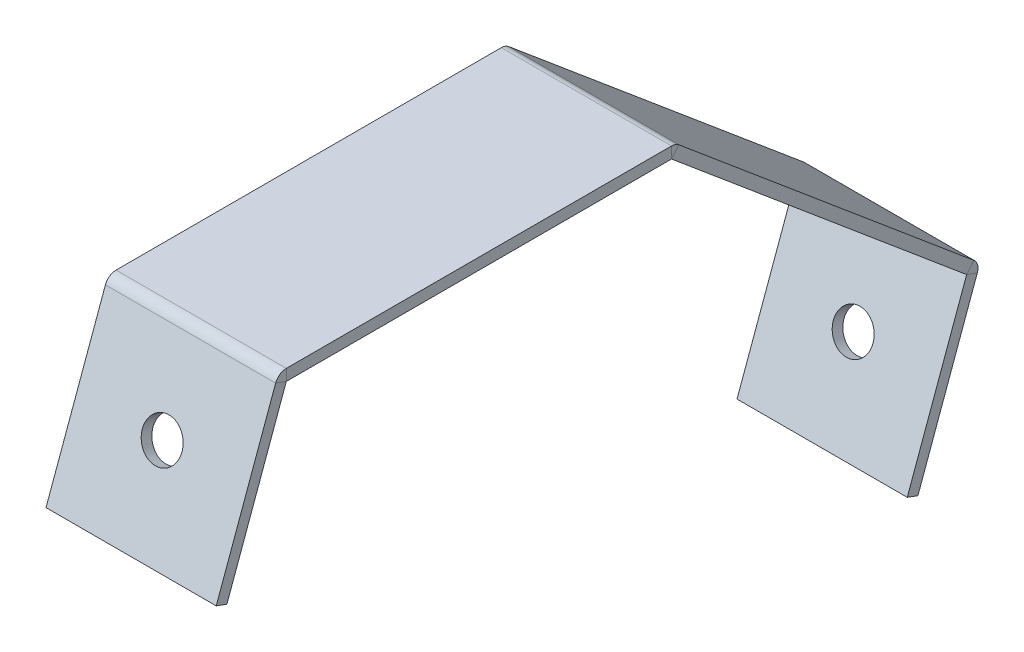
ISO-10303-21;
HEADER;
FILE_DESCRIPTION(('STEP AP214'),'2;1');
FILE_NAME('part.step','',(''),(''),'','','');
FILE_SCHEMA(('AUTOMOTIVE_DESIGN { 1 0 10303 214 1 1 1 1 }'));
ENDSEC;
DATA;
#1=APPLICATION_CONTEXT('core data for automotive mechanical design processes');
#2=APPLICATION_PROTOCOL_DEFINITION('international standard','automotive_design',2000,#1);
#3=PRODUCT_CONTEXT('',#1,'mechanical');
#4=PRODUCT('Part','Part','',(#3));
#5=PRODUCT_RELATED_PRODUCT_CATEGORY('part','',(#4));
#6=PRODUCT_DEFINITION_FORMATION('','',#4);
#7=PRODUCT_DEFINITION_CONTEXT('part definition',#1,'design');
#8=PRODUCT_DEFINITION('design','',#6,#7);
#9=PRODUCT_DEFINITION_SHAPE('','',#8);
#10=(LENGTH_UNIT() NAMED_UNIT(*) SI_UNIT(.MILLI.,.METRE.));
#11=(NAMED_UNIT(*) PLANE_ANGLE_UNIT() SI_UNIT($,.RADIAN.));
#12=(NAMED_UNIT(*) SI_UNIT($,.STERADIAN.) SOLID_ANGLE_UNIT());
#13=UNCERTAINTY_MEASURE_WITH_UNIT(LENGTH_MEASURE(1.E-05),#10,'distance_accuracy_value','');
#14=(GEOMETRIC_REPRESENTATION_CONTEXT(3) GLOBAL_UNCERTAINTY_ASSIGNED_CONTEXT((#13)) GLOBAL_UNIT_ASSIGNED_CONTEXT((#10,
#11,#12)) REPRESENTATION_CONTEXT('',''));
#15=CARTESIAN_POINT('',(0.,0.,0.));
#16=DIRECTION('',(0.,0.,1.));
#17=DIRECTION('',(1.,0.,0.));
#18=AXIS2_PLACEMENT_3D('',#15,#16,#17);
#19=CARTESIAN_POINT('',(0.,-31.785382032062,-90.0770968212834));
#20=DIRECTION('',(0.,-0.766044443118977,0.642787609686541));
#21=DIRECTION('',(0.,-0.642787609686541,-0.766044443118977));
#22=AXIS2_PLACEMENT_3D('',#19,#20,#21);
#23=PLANE('',#22);
#24=DIRECTION('',(0.,0.642787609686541,0.766044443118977));
#25=VECTOR('',#24,1.);
#26=CARTESIAN_POINT('',(0.,33.7789541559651,-11.9405636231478));
#27=LINE('',#26,#25);
#28=CARTESIAN_POINT('',(0.,-21.0539094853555,-77.2878258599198));
#29=VERTEX_POINT('',#28);
#30=CARTESIAN_POINT('',(0.,0.766044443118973,-51.2838173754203));
#31=VERTEX_POINT('',#30);
#32=EDGE_CURVE('E48',#29,#31,#27,.T.);
#33=ORIENTED_EDGE('',*,*,#32,.T.);
#34=DIRECTION('',(1.,0.,0.));
#35=VECTOR('',#34,1.);
#36=CARTESIAN_POINT('',(0.,0.766044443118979,-51.2838173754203));
#37=LINE('',#36,#35);
#38=CARTESIAN_POINT('',(15.,0.766044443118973,-51.2838173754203));
#39=VERTEX_POINT('',#38);
#40=EDGE_CURVE('E169',#31,#39,#37,.T.);
#41=ORIENTED_EDGE('',*,*,#40,.T.);
#42=DIRECTION('',(0.,-0.642787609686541,-0.766044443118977));
#43=VECTOR('',#42,1.);
#44=CARTESIAN_POINT('',(15.,33.7789541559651,-11.9405636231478));
#45=LINE('',#44,#43);
#46=CARTESIAN_POINT('',(15.,-21.0539094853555,-77.2878258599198));
#47=VERTEX_POINT('',#46);
#48=EDGE_CURVE('E227',#39,#47,#45,.T.);
#49=ORIENTED_EDGE('',*,*,#48,.T.);
#50=DIRECTION('',(-1.,0.,0.));
#51=VECTOR('',#50,1.);
#52=CARTESIAN_POINT('',(0.,-21.0539094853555,-77.2878258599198));
#53=LINE('',#52,#51);
#54=EDGE_CURVE('E223',#47,#29,#53,.T.);
#55=ORIENTED_EDGE('',*,*,#54,.T.);
#56=EDGE_LOOP('',(#33,#41,#49,#55));
#57=FACE_BOUND('',#56,.T.);
#58=ADVANCED_FACE('F44',(#57),#23,.F.);
#59=CARTESIAN_POINT('',(0.,33.7789541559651,-11.9405636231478));
#60=DIRECTION('',(1.,0.,0.));
#61=DIRECTION('',(0.,-0.642787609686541,-0.766044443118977));
#62=AXIS2_PLACEMENT_3D('',#59,#60,#61);
#63=PLANE('',#62);
#64=DIRECTION('',(0.,0.642787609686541,0.766044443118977));
#65=VECTOR('',#64,1.);
#66=CARTESIAN_POINT('',(0.,33.0129097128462,-11.2977760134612));
#67=LINE('',#66,#65);
#68=CARTESIAN_POINT('',(0.,-21.8199539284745,-76.6450382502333));
#69=VERTEX_POINT('',#68);
#70=CARTESIAN_POINT('',(0.,0.,-50.6410297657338));
#71=VERTEX_POINT('',#70);
#72=EDGE_CURVE('E222',#69,#71,#67,.T.);
#73=ORIENTED_EDGE('',*,*,#72,.T.);
#74=DIRECTION('',(0.,0.766044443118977,-0.642787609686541));
#75=VECTOR('',#74,1.);
#76=CARTESIAN_POINT('',(0.,0.766044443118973,-51.2838173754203));
#77=LINE('',#76,#75);
#78=EDGE_CURVE('E53',#71,#31,#77,.T.);
#79=ORIENTED_EDGE('',*,*,#78,.T.);
#80=ORIENTED_EDGE('',*,*,#32,.F.);
#81=DIRECTION('',(0.,-0.766044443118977,0.642787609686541));
#82=VECTOR('',#81,1.);
#83=CARTESIAN_POINT('',(0.,-21.0539094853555,-77.2878258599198));
#84=LINE('',#83,#82);
#85=EDGE_CURVE('E233',#29,#69,#84,.T.);
#86=ORIENTED_EDGE('',*,*,#85,.T.);
#87=EDGE_LOOP('',(#73,#79,#80,#86));
#88=FACE_BOUND('',#87,.T.);
#89=ADVANCED_FACE('F245',(#88),#63,.F.);
#90=CARTESIAN_POINT('',(15.,33.7789541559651,-11.9405636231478));
#91=DIRECTION('',(-1.,0.,0.));
#92=DIRECTION('',(0.,0.642787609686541,0.766044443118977));
#93=AXIS2_PLACEMENT_3D('',#90,#91,#92);
#94=PLANE('',#93);
#95=ORIENTED_EDGE('',*,*,#48,.F.);
#96=DIRECTION('',(0.,-0.766044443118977,0.642787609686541));
#97=VECTOR('',#96,1.);
#98=CARTESIAN_POINT('',(15.,0.766044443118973,-51.2838173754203));
#99=LINE('',#98,#97);
#100=CARTESIAN_POINT('',(15.,0.,-50.6410297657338));
#101=VERTEX_POINT('',#100);
#102=EDGE_CURVE('E12',#39,#101,#99,.T.);
#103=ORIENTED_EDGE('',*,*,#102,.T.);
#104=DIRECTION('',(0.,-0.642787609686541,-0.766044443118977));
#105=VECTOR('',#104,1.);
#106=CARTESIAN_POINT('',(15.,33.0129097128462,-11.2977760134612));
#107=LINE('',#106,#105);
#108=CARTESIAN_POINT('',(15.,-21.8199539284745,-76.6450382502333));
#109=VERTEX_POINT('',#108);
#110=EDGE_CURVE('E238',#101,#109,#107,.T.);
#111=ORIENTED_EDGE('',*,*,#110,.T.);
#112=DIRECTION('',(0.,0.766044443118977,-0.642787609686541));
#113=VECTOR('',#112,1.);
#114=CARTESIAN_POINT('',(15.,-21.0539094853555,-77.2878258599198));
#115=LINE('',#114,#113);
#116=EDGE_CURVE('E226',#109,#47,#115,.T.);
#117=ORIENTED_EDGE('',*,*,#116,.T.);
#118=EDGE_LOOP('',(#95,#103,#111,#117));
#119=FACE_BOUND('',#118,.T.);
#120=ADVANCED_FACE('F46',(#119),#94,.F.);
#121=CARTESIAN_POINT('',(0.,-32.551426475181,-89.4343092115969));
#122=DIRECTION('',(0.,-0.766044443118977,0.642787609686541));
#123=DIRECTION('',(0.,-0.642787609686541,-0.766044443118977));
#124=AXIS2_PLACEMENT_3D('',#121,#122,#123);
#125=PLANE('',#124);
#126=DIRECTION('',(1.,0.,0.));
#127=VECTOR('',#126,1.);
#128=CARTESIAN_POINT('',(0.,0.,-50.6410297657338));
#129=LINE('',#128,#127);
#130=EDGE_CURVE('E252',#71,#101,#129,.T.);
#131=ORIENTED_EDGE('',*,*,#130,.F.);
#132=ORIENTED_EDGE('',*,*,#72,.F.);
#133=DIRECTION('',(-1.,0.,0.));
#134=VECTOR('',#133,1.);
#135=CARTESIAN_POINT('',(0.,-21.8199539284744,-76.6450382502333));
#136=LINE('',#135,#134);
#137=EDGE_CURVE('E230',#109,#69,#136,.T.);
#138=ORIENTED_EDGE('',*,*,#137,.F.);
#139=ORIENTED_EDGE('',*,*,#110,.F.);
#140=EDGE_LOOP('',(#131,#132,#138,#139));
#141=FACE_BOUND('',#140,.T.);
#142=ADVANCED_FACE('F253',(#141),#125,.T.);
#143=CARTESIAN_POINT('',(15.,-21.8199539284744,-76.6450382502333));
#144=DIRECTION('',(1.,0.,0.));
#145=DIRECTION('',(0.,-0.642787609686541,-0.766044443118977));
#146=AXIS2_PLACEMENT_3D('',#143,#144,#145);
#147=CYLINDRICAL_SURFACE('',#146,1.);
#148=CARTESIAN_POINT('',(15.,-21.8199539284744,-76.6450382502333));
#149=DIRECTION('',(1.,0.,0.));
#150=DIRECTION('',(0.,-0.642787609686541,-0.766044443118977));
#151=AXIS2_PLACEMENT_3D('',#148,#149,#150);
#152=CIRCLE('',#151,1.);
#153=CARTESIAN_POINT('',(15.,-22.1619740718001,-77.5847308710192));
#154=VERTEX_POINT('',#153);
#155=EDGE_CURVE('E219',#154,#47,#152,.T.);
#156=ORIENTED_EDGE('',*,*,#155,.F.);
#157=DIRECTION('',(-1.,0.,0.));
#158=VECTOR('',#157,1.);
#159=CARTESIAN_POINT('',(0.,-22.1619740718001,-77.5847308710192));
#160=LINE('',#159,#158);
#161=CARTESIAN_POINT('',(0.,-22.1619740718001,-77.5847308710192));
#162=VERTEX_POINT('',#161);
#163=EDGE_CURVE('E214',#154,#162,#160,.T.);
#164=ORIENTED_EDGE('',*,*,#163,.T.);
#165=CARTESIAN_POINT('',(0.,-21.8199539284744,-76.6450382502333));
#166=DIRECTION('',(1.,0.,0.));
#167=DIRECTION('',(0.,-0.642787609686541,-0.766044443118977));
#168=AXIS2_PLACEMENT_3D('',#165,#166,#167);
#169=CIRCLE('',#168,1.);
#170=EDGE_CURVE('E186',#162,#29,#169,.T.);
#171=ORIENTED_EDGE('',*,*,#170,.T.);
#172=ORIENTED_EDGE('',*,*,#54,.F.);
#173=EDGE_LOOP('',(#156,#164,#171,#172));
#174=FACE_BOUND('',#173,.T.);
#175=ADVANCED_FACE('F356',(#174),#147,.T.);
#176=CARTESIAN_POINT('',(15.,-22.1619740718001,-77.5847308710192));
#177=DIRECTION('',(1.,0.,0.));
#178=DIRECTION('',(0.,-0.642787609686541,-0.766044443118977));
#179=AXIS2_PLACEMENT_3D('',#176,#177,#178);
#180=PLANE('',#179);
#181=ORIENTED_EDGE('',*,*,#116,.F.);
#182=DIRECTION('',(0.,-0.342020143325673,-0.939692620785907));
#183=VECTOR('',#182,1.);
#184=CARTESIAN_POINT('',(15.,-22.1619740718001,-77.5847308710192));
#185=LINE('',#184,#183);
#186=EDGE_CURVE('E208',#109,#154,#185,.T.);
#187=ORIENTED_EDGE('',*,*,#186,.T.);
#188=ORIENTED_EDGE('',*,*,#155,.T.);
#189=EDGE_LOOP('',(#181,#187,#188));
#190=FACE_BOUND('',#189,.T.);
#191=ADVANCED_FACE('F353',(#190),#180,.T.);
#192=CARTESIAN_POINT('',(0.,-22.1619740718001,-77.5847308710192));
#193=DIRECTION('',(-1.,0.,0.));
#194=DIRECTION('',(0.,0.642787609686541,0.766044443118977));
#195=AXIS2_PLACEMENT_3D('',#192,#193,#194);
#196=PLANE('',#195);
#197=DIRECTION('',(0.,0.342020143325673,0.939692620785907));
#198=VECTOR('',#197,1.);
#199=CARTESIAN_POINT('',(0.,-22.1619740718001,-77.5847308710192));
#200=LINE('',#199,#198);
#201=EDGE_CURVE('E211',#162,#69,#200,.T.);
#202=ORIENTED_EDGE('',*,*,#201,.T.);
#203=ORIENTED_EDGE('',*,*,#85,.F.);
#204=ORIENTED_EDGE('',*,*,#170,.F.);
#205=EDGE_LOOP('',(#202,#203,#204));
#206=FACE_BOUND('',#205,.T.);
#207=ADVANCED_FACE('F377',(#206),#196,.T.);
#208=CARTESIAN_POINT('',(7.5,-29.026233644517,-75.0863447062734));
#209=DIRECTION('',(0.,0.342020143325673,0.939692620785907));
#210=DIRECTION('',(0.,-0.939692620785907,0.342020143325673));
#211=AXIS2_PLACEMENT_3D('',#208,#209,#210);
#212=CYLINDRICAL_SURFACE('',#211,1.75);
#213=CARTESIAN_POINT('',(7.5,-29.026233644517,-75.0863447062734));
#214=DIRECTION('',(0.,-0.342020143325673,-0.939692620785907));
#215=DIRECTION('',(0.,0.939692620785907,-0.342020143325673));
#216=AXIS2_PLACEMENT_3D('',#213,#214,#215);
#217=CIRCLE('',#216,1.75);
#218=CARTESIAN_POINT('',(7.5,-27.3817715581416,-75.6848799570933));
#219=VERTEX_POINT('',#218);
#220=EDGE_CURVE('E205',#219,#219,#217,.T.);
#221=ORIENTED_EDGE('',*,*,#220,.T.);
#222=EDGE_LOOP('',(#221));
#223=FACE_BOUND('',#222,.T.);
#224=CARTESIAN_POINT('',(7.5,-28.6842135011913,-74.1466520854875));
#225=DIRECTION('',(0.,-0.342020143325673,-0.939692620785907));
#226=DIRECTION('',(0.,0.939692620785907,-0.342020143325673));
#227=AXIS2_PLACEMENT_3D('',#224,#225,#226);
#228=CIRCLE('',#227,1.75);
#229=CARTESIAN_POINT('',(7.5,-27.039751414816,-74.7451873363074));
#230=VERTEX_POINT('',#229);
#231=EDGE_CURVE('E190',#230,#230,#228,.T.);
#232=ORIENTED_EDGE('',*,*,#231,.F.);
#233=EDGE_LOOP('',(#232));
#234=FACE_BOUND('',#233,.T.);
#235=ADVANCED_FACE('F402',(#223,#234),#212,.F.);
#236=CARTESIAN_POINT('',(0.,-36.5437746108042,-72.350183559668));
#237=DIRECTION('',(0.,0.939692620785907,-0.342020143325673));
#238=DIRECTION('',(1.,0.,0.));
#239=AXIS2_PLACEMENT_3D('',#236,#237,#238);
#240=PLANE('',#239);
#241=DIRECTION('',(-1.,0.,0.));
#242=VECTOR('',#241,1.);
#243=CARTESIAN_POINT('',(0.,-36.2017544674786,-71.4104909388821));
#244=LINE('',#243,#242);
#245=CARTESIAN_POINT('',(15.,-36.2017544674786,-71.4104909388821));
#246=VERTEX_POINT('',#245);
#247=CARTESIAN_POINT('',(0.,-36.2017544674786,-71.4104909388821));
#248=VERTEX_POINT('',#247);
#249=EDGE_CURVE('E203',#246,#248,#244,.T.);
#250=ORIENTED_EDGE('',*,*,#249,.T.);
#251=DIRECTION('',(0.,0.342020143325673,0.939692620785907));
#252=VECTOR('',#251,1.);
#253=CARTESIAN_POINT('',(0.,-36.5437746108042,-72.350183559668));
#254=LINE('',#253,#252);
#255=CARTESIAN_POINT('',(0.,-36.5437746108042,-72.350183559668));
#256=VERTEX_POINT('',#255);
#257=EDGE_CURVE('E187',#256,#248,#254,.T.);
#258=ORIENTED_EDGE('',*,*,#257,.F.);
#259=DIRECTION('',(-1.,0.,0.));
#260=VECTOR('',#259,1.);
#261=CARTESIAN_POINT('',(0.,-36.5437746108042,-72.350183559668));
#262=LINE('',#261,#260);
#263=CARTESIAN_POINT('',(15.,-36.5437746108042,-72.350183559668));
#264=VERTEX_POINT('',#263);
#265=EDGE_CURVE('E197',#264,#256,#262,.T.);
#266=ORIENTED_EDGE('',*,*,#265,.F.);
#267=DIRECTION('',(0.,0.342020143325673,0.939692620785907));
#268=VECTOR('',#267,1.);
#269=CARTESIAN_POINT('',(15.,-36.5437746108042,-72.350183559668));
#270=LINE('',#269,#268);
#271=EDGE_CURVE('E200',#264,#246,#270,.T.);
#272=ORIENTED_EDGE('',*,*,#271,.T.);
#273=EDGE_LOOP('',(#250,#258,#266,#272));
#274=FACE_BOUND('',#273,.T.);
#275=ADVANCED_FACE('F384',(#274),#240,.F.);
#276=CARTESIAN_POINT('',(0.,-36.5437746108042,-72.350183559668));
#277=DIRECTION('',(0.,0.342020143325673,0.939692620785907));
#278=DIRECTION('',(0.,-0.939692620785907,0.342020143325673));
#279=AXIS2_PLACEMENT_3D('',#276,#277,#278);
#280=PLANE('',#279);
#281=ORIENTED_EDGE('',*,*,#163,.F.);
#282=DIRECTION('',(0.,-0.939692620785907,0.342020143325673));
#283=VECTOR('',#282,1.);
#284=CARTESIAN_POINT('',(15.,59.3048727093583,-107.236238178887));
#285=LINE('',#284,#283);
#286=EDGE_CURVE('E69',#154,#264,#285,.T.);
#287=ORIENTED_EDGE('',*,*,#286,.T.);
#288=ORIENTED_EDGE('',*,*,#265,.T.);
#289=DIRECTION('',(0.,0.939692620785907,-0.342020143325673));
#290=VECTOR('',#289,1.);
#291=CARTESIAN_POINT('',(0.,59.3048727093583,-107.236238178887));
#292=LINE('',#291,#290);
#293=EDGE_CURVE('E195',#256,#162,#292,.T.);
#294=ORIENTED_EDGE('',*,*,#293,.T.);
#295=EDGE_LOOP('',(#281,#287,#288,#294));
#296=FACE_BOUND('',#295,.T.);
#297=ORIENTED_EDGE('',*,*,#220,.F.);
#298=EDGE_LOOP('',(#297));
#299=FACE_BOUND('',#298,.T.);
#300=ADVANCED_FACE('F387',(#296,#299),#280,.F.);
#301=CARTESIAN_POINT('',(15.,59.3048727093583,-107.236238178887));
#302=DIRECTION('',(-1.,0.,0.));
#303=DIRECTION('',(0.,0.939692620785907,-0.342020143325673));
#304=AXIS2_PLACEMENT_3D('',#301,#302,#303);
#305=PLANE('',#304);
#306=ORIENTED_EDGE('',*,*,#186,.F.);
#307=DIRECTION('',(0.,-0.939692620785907,0.342020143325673));
#308=VECTOR('',#307,1.);
#309=CARTESIAN_POINT('',(15.,59.646892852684,-106.296545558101));
#310=LINE('',#309,#308);
#311=EDGE_CURVE('E193',#109,#246,#310,.T.);
#312=ORIENTED_EDGE('',*,*,#311,.T.);
#313=ORIENTED_EDGE('',*,*,#271,.F.);
#314=ORIENTED_EDGE('',*,*,#286,.F.);
#315=EDGE_LOOP('',(#306,#312,#313,#314));
#316=FACE_BOUND('',#315,.T.);
#317=ADVANCED_FACE('F385',(#316),#305,.F.);
#318=CARTESIAN_POINT('',(0.,-36.2017544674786,-71.4104909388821));
#319=DIRECTION('',(0.,0.342020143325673,0.939692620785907));
#320=DIRECTION('',(0.,-0.939692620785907,0.342020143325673));
#321=AXIS2_PLACEMENT_3D('',#318,#319,#320);
#322=PLANE('',#321);
#323=ORIENTED_EDGE('',*,*,#231,.T.);
#324=EDGE_LOOP('',(#323));
#325=FACE_BOUND('',#324,.T.);
#326=ORIENTED_EDGE('',*,*,#311,.F.);
#327=ORIENTED_EDGE('',*,*,#137,.T.);
#328=DIRECTION('',(0.,0.939692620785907,-0.342020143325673));
#329=VECTOR('',#328,1.);
#330=CARTESIAN_POINT('',(0.,59.646892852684,-106.296545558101));
#331=LINE('',#330,#329);
#332=EDGE_CURVE('E184',#248,#69,#331,.T.);
#333=ORIENTED_EDGE('',*,*,#332,.F.);
#334=ORIENTED_EDGE('',*,*,#249,.F.);
#335=EDGE_LOOP('',(#326,#327,#333,#334));
#336=FACE_BOUND('',#335,.T.);
#337=ADVANCED_FACE('F372',(#325,#336),#322,.T.);
#338=CARTESIAN_POINT('',(0.,59.3048727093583,-107.236238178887));
#339=DIRECTION('',(1.,0.,0.));
#340=DIRECTION('',(0.,-0.939692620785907,0.342020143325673));
#341=AXIS2_PLACEMENT_3D('',#338,#339,#340);
#342=PLANE('',#341);
#343=ORIENTED_EDGE('',*,*,#201,.F.);
#344=ORIENTED_EDGE('',*,*,#293,.F.);
#345=ORIENTED_EDGE('',*,*,#257,.T.);
#346=ORIENTED_EDGE('',*,*,#332,.T.);
#347=EDGE_LOOP('',(#343,#344,#345,#346));
#348=FACE_BOUND('',#347,.T.);
#349=ADVANCED_FACE('F380',(#348),#342,.F.);
#350=CARTESIAN_POINT('',(7.5,-6.5222394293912,-13.257128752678));
#351=DIRECTION('',(0.,-0.342020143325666,-0.93969262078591));
#352=DIRECTION('',(0.,0.93969262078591,-0.342020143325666));
#353=AXIS2_PLACEMENT_3D('',#350,#351,#352);
#354=CYLINDRICAL_SURFACE('',#353,1.75);
#355=CARTESIAN_POINT('',(7.5,-6.5222394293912,-13.257128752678));
#356=DIRECTION('',(0.,0.342020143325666,0.93969262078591));
#357=DIRECTION('',(0.,-0.93969262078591,0.342020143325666));
#358=AXIS2_PLACEMENT_3D('',#355,#356,#357);
#359=CIRCLE('',#358,1.75);
#360=CARTESIAN_POINT('',(7.5,-8.16670151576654,-12.6585935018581));
#361=VERTEX_POINT('',#360);
#362=EDGE_CURVE('E176',#361,#361,#359,.T.);
#363=ORIENTED_EDGE('',*,*,#362,.T.);
#364=EDGE_LOOP('',(#363));
#365=FACE_BOUND('',#364,.T.);
#366=CARTESIAN_POINT('',(7.5,-6.86425957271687,-14.196821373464));
#367=DIRECTION('',(0.,0.342020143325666,0.93969262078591));
#368=DIRECTION('',(0.,-0.93969262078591,0.342020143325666));
#369=AXIS2_PLACEMENT_3D('',#366,#367,#368);
#370=CIRCLE('',#369,1.75);
#371=CARTESIAN_POINT('',(7.5,-8.50872165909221,-13.598286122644));
#372=VERTEX_POINT('',#371);
#373=EDGE_CURVE('E273',#372,#372,#370,.T.);
#374=ORIENTED_EDGE('',*,*,#373,.F.);
#375=EDGE_LOOP('',(#374));
#376=FACE_BOUND('',#375,.T.);
#377=ADVANCED_FACE('F400',(#365,#376),#354,.F.);
#378=CARTESIAN_POINT('',(0.,-14.0397803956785,-10.5209676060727));
#379=DIRECTION('',(0.,0.93969262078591,-0.342020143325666));
#380=DIRECTION('',(-1.,0.,0.));
#381=AXIS2_PLACEMENT_3D('',#378,#379,#380);
#382=PLANE('',#381);
#383=DIRECTION('',(1.,0.,0.));
#384=VECTOR('',#383,1.);
#385=CARTESIAN_POINT('',(0.,-14.3818005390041,-11.4606602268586));
#386=LINE('',#385,#384);
#387=CARTESIAN_POINT('',(0.,-14.3818005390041,-11.4606602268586));
#388=VERTEX_POINT('',#387);
#389=CARTESIAN_POINT('',(15.,-14.3818005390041,-11.4606602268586));
#390=VERTEX_POINT('',#389);
#391=EDGE_CURVE('E179',#388,#390,#386,.T.);
#392=ORIENTED_EDGE('',*,*,#391,.T.);
#393=DIRECTION('',(0.,-0.342020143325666,-0.93969262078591));
#394=VECTOR('',#393,1.);
#395=CARTESIAN_POINT('',(15.,-14.0397803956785,-10.5209676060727));
#396=LINE('',#395,#394);
#397=CARTESIAN_POINT('',(15.,-14.0397803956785,-10.5209676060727));
#398=VERTEX_POINT('',#397);
#399=EDGE_CURVE('E294',#398,#390,#396,.T.);
#400=ORIENTED_EDGE('',*,*,#399,.F.);
#401=DIRECTION('',(1.,0.,0.));
#402=VECTOR('',#401,1.);
#403=CARTESIAN_POINT('',(0.,-14.0397803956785,-10.5209676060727));
#404=LINE('',#403,#402);
#405=CARTESIAN_POINT('',(0.,-14.0397803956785,-10.5209676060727));
#406=VERTEX_POINT('',#405);
#407=EDGE_CURVE('E279',#406,#398,#404,.T.);
#408=ORIENTED_EDGE('',*,*,#407,.F.);
#409=DIRECTION('',(0.,-0.342020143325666,-0.93969262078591));
#410=VECTOR('',#409,1.);
#411=CARTESIAN_POINT('',(0.,-14.0397803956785,-10.5209676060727));
#412=LINE('',#411,#410);
#413=EDGE_CURVE('E303',#406,#388,#412,.T.);
#414=ORIENTED_EDGE('',*,*,#413,.T.);
#415=EDGE_LOOP('',(#392,#400,#408,#414));
#416=FACE_BOUND('',#415,.T.);
#417=ADVANCED_FACE('F308',(#416),#382,.F.);
#418=CARTESIAN_POINT('',(15.,-14.0397803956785,-10.5209676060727));
#419=DIRECTION('',(-1.,0.,0.));
#420=DIRECTION('',(0.,-0.93969262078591,0.342020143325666));
#421=AXIS2_PLACEMENT_3D('',#418,#419,#420);
#422=PLANE('',#421);
#423=DIRECTION('',(0.,0.93969262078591,-0.342020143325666));
#424=VECTOR('',#423,1.);
#425=CARTESIAN_POINT('',(15.,-14.3818005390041,-11.4606602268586));
#426=LINE('',#425,#424);
#427=CARTESIAN_POINT('',(15.,0.,-16.6952075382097));
#428=VERTEX_POINT('',#427);
#429=EDGE_CURVE('E300',#390,#428,#426,.T.);
#430=ORIENTED_EDGE('',*,*,#429,.T.);
#431=DIRECTION('',(0.,0.342020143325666,0.93969262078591));
#432=VECTOR('',#431,1.);
#433=CARTESIAN_POINT('',(15.,0.342020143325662,-15.7555149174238));
#434=LINE('',#433,#432);
#435=CARTESIAN_POINT('',(15.,0.342020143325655,-15.7555149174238));
#436=VERTEX_POINT('',#435);
#437=EDGE_CURVE('E297',#428,#436,#434,.T.);
#438=ORIENTED_EDGE('',*,*,#437,.T.);
#439=DIRECTION('',(0.,0.93969262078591,-0.342020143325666));
#440=VECTOR('',#439,1.);
#441=CARTESIAN_POINT('',(15.,-14.0397803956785,-10.5209676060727));
#442=LINE('',#441,#440);
#443=EDGE_CURVE('E286',#398,#436,#442,.T.);
#444=ORIENTED_EDGE('',*,*,#443,.F.);
#445=ORIENTED_EDGE('',*,*,#399,.T.);
#446=EDGE_LOOP('',(#430,#438,#444,#445));
#447=FACE_BOUND('',#446,.T.);
#448=ADVANCED_FACE('F316',(#447),#422,.F.);
#449=CARTESIAN_POINT('',(0.,-14.0397803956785,-10.5209676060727));
#450=DIRECTION('',(1.,0.,0.));
#451=DIRECTION('',(0.,0.93969262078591,-0.342020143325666));
#452=AXIS2_PLACEMENT_3D('',#449,#450,#451);
#453=PLANE('',#452);
#454=DIRECTION('',(0.,-0.93969262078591,0.342020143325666));
#455=VECTOR('',#454,1.);
#456=CARTESIAN_POINT('',(0.,-14.0397803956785,-10.5209676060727));
#457=LINE('',#456,#455);
#458=CARTESIAN_POINT('',(0.,0.342020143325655,-15.7555149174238));
#459=VERTEX_POINT('',#458);
#460=EDGE_CURVE('E281',#459,#406,#457,.T.);
#461=ORIENTED_EDGE('',*,*,#460,.F.);
#462=DIRECTION('',(0.,-0.342020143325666,-0.93969262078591));
#463=VECTOR('',#462,1.);
#464=CARTESIAN_POINT('',(0.,0.342020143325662,-15.7555149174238));
#465=LINE('',#464,#463);
#466=CARTESIAN_POINT('',(0.,0.,-16.6952075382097));
#467=VERTEX_POINT('',#466);
#468=EDGE_CURVE('E291',#459,#467,#465,.T.);
#469=ORIENTED_EDGE('',*,*,#468,.T.);
#470=DIRECTION('',(0.,-0.93969262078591,0.342020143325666));
#471=VECTOR('',#470,1.);
#472=CARTESIAN_POINT('',(0.,-14.3818005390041,-11.4606602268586));
#473=LINE('',#472,#471);
#474=EDGE_CURVE('E289',#467,#388,#473,.T.);
#475=ORIENTED_EDGE('',*,*,#474,.T.);
#476=ORIENTED_EDGE('',*,*,#413,.F.);
#477=EDGE_LOOP('',(#461,#469,#475,#476));
#478=FACE_BOUND('',#477,.T.);
#479=ADVANCED_FACE('F335',(#478),#453,.F.);
#480=CARTESIAN_POINT('',(0.,81.8088669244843,-45.4070222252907));
#481=DIRECTION('',(0.,-0.342020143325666,-0.93969262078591));
#482=DIRECTION('',(0.,0.93969262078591,-0.342020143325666));
#483=AXIS2_PLACEMENT_3D('',#480,#481,#482);
#484=PLANE('',#483);
#485=ORIENTED_EDGE('',*,*,#362,.F.);
#486=EDGE_LOOP('',(#485));
#487=FACE_BOUND('',#486,.T.);
#488=ORIENTED_EDGE('',*,*,#443,.T.);
#489=DIRECTION('',(-1.,0.,0.));
#490=VECTOR('',#489,1.);
#491=CARTESIAN_POINT('',(0.,0.342020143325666,-15.7555149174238));
#492=LINE('',#491,#490);
#493=EDGE_CURVE('E283',#436,#459,#492,.T.);
#494=ORIENTED_EDGE('',*,*,#493,.T.);
#495=ORIENTED_EDGE('',*,*,#460,.T.);
#496=ORIENTED_EDGE('',*,*,#407,.T.);
#497=EDGE_LOOP('',(#488,#494,#495,#496));
#498=FACE_BOUND('',#497,.T.);
#499=ADVANCED_FACE('F333',(#487,#498),#484,.F.);
#500=CARTESIAN_POINT('',(15.,0.342020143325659,-15.7555149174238));
#501=DIRECTION('',(-1.,0.,0.));
#502=DIRECTION('',(0.,0.,1.));
#503=AXIS2_PLACEMENT_3D('',#500,#501,#502);
#504=PLANE('',#503);
#505=ORIENTED_EDGE('',*,*,#437,.F.);
#506=DIRECTION('',(0.,1.,0.));
#507=VECTOR('',#506,1.);
#508=CARTESIAN_POINT('',(15.,0.999999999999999,-16.6952075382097));
#509=LINE('',#508,#507);
#510=CARTESIAN_POINT('',(15.,1.,-16.6952075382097));
#511=VERTEX_POINT('',#510);
#512=EDGE_CURVE('E276',#428,#511,#509,.T.);
#513=ORIENTED_EDGE('',*,*,#512,.T.);
#514=CARTESIAN_POINT('',(15.,0.,-16.6952075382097));
#515=DIRECTION('',(-1.,0.,0.));
#516=DIRECTION('',(0.,0.,1.));
#517=AXIS2_PLACEMENT_3D('',#514,#515,#516);
#518=CIRCLE('',#517,0.999999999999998);
#519=EDGE_CURVE('E267',#436,#511,#518,.T.);
#520=ORIENTED_EDGE('',*,*,#519,.F.);
#521=EDGE_LOOP('',(#505,#513,#520));
#522=FACE_BOUND('',#521,.T.);
#523=ADVANCED_FACE('F326',(#522),#504,.F.);
#524=CARTESIAN_POINT('',(0.,81.4668467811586,-46.3467148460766));
#525=DIRECTION('',(0.,-0.342020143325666,-0.93969262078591));
#526=DIRECTION('',(0.,0.93969262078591,-0.342020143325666));
#527=AXIS2_PLACEMENT_3D('',#524,#525,#526);
#528=PLANE('',#527);
#529=DIRECTION('',(-1.,0.,0.));
#530=VECTOR('',#529,1.);
#531=CARTESIAN_POINT('',(0.,0.,-16.6952075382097));
#532=LINE('',#531,#530);
#533=EDGE_CURVE('E256',#428,#467,#532,.T.);
#534=ORIENTED_EDGE('',*,*,#533,.F.);
#535=ORIENTED_EDGE('',*,*,#429,.F.);
#536=ORIENTED_EDGE('',*,*,#391,.F.);
#537=ORIENTED_EDGE('',*,*,#474,.F.);
#538=EDGE_LOOP('',(#534,#535,#536,#537));
#539=FACE_BOUND('',#538,.T.);
#540=ORIENTED_EDGE('',*,*,#373,.T.);
#541=EDGE_LOOP('',(#540));
#542=FACE_BOUND('',#541,.T.);
#543=ADVANCED_FACE('F318',(#539,#542),#528,.T.);
#544=CARTESIAN_POINT('',(0.,0.342020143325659,-15.7555149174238));
#545=DIRECTION('',(1.,0.,0.));
#546=DIRECTION('',(0.,0.,-1.));
#547=AXIS2_PLACEMENT_3D('',#544,#545,#546);
#548=PLANE('',#547);
#549=DIRECTION('',(0.,-1.,0.));
#550=VECTOR('',#549,1.);
#551=CARTESIAN_POINT('',(0.,0.999999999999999,-16.6952075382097));
#552=LINE('',#551,#550);
#553=CARTESIAN_POINT('',(0.,1.,-16.6952075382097));
#554=VERTEX_POINT('',#553);
#555=EDGE_CURVE('E151',#554,#467,#552,.T.);
#556=ORIENTED_EDGE('',*,*,#555,.T.);
#557=ORIENTED_EDGE('',*,*,#468,.F.);
#558=CARTESIAN_POINT('',(0.,0.,-16.6952075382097));
#559=DIRECTION('',(-1.,0.,0.));
#560=DIRECTION('',(0.,0.,1.));
#561=AXIS2_PLACEMENT_3D('',#558,#559,#560);
#562=CIRCLE('',#561,0.999999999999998);
#563=EDGE_CURVE('E270',#459,#554,#562,.T.);
#564=ORIENTED_EDGE('',*,*,#563,.T.);
#565=EDGE_LOOP('',(#556,#557,#564));
#566=FACE_BOUND('',#565,.T.);
#567=ADVANCED_FACE('F337',(#566),#548,.F.);
#568=CARTESIAN_POINT('',(0.,0.,-16.6952075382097));
#569=DIRECTION('',(-1.,0.,0.));
#570=DIRECTION('',(0.,0.,1.));
#571=AXIS2_PLACEMENT_3D('',#568,#569,#570);
#572=CYLINDRICAL_SURFACE('',#571,0.999999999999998);
#573=ORIENTED_EDGE('',*,*,#563,.F.);
#574=ORIENTED_EDGE('',*,*,#493,.F.);
#575=ORIENTED_EDGE('',*,*,#519,.T.);
#576=DIRECTION('',(-1.,0.,0.));
#577=VECTOR('',#576,1.);
#578=CARTESIAN_POINT('',(0.,1.,-16.6952075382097));
#579=LINE('',#578,#577);
#580=EDGE_CURVE('E156',#511,#554,#579,.T.);
#581=ORIENTED_EDGE('',*,*,#580,.T.);
#582=EDGE_LOOP('',(#573,#574,#575,#581));
#583=FACE_BOUND('',#582,.T.);
#584=ADVANCED_FACE('F329',(#583),#572,.T.);
#585=CARTESIAN_POINT('',(0.,1.,-102.));
#586=DIRECTION('',(0.,-1.,0.));
#587=DIRECTION('',(0.,0.,-1.));
#588=AXIS2_PLACEMENT_3D('',#585,#586,#587);
#589=PLANE('',#588);
#590=DIRECTION('',(1.,0.,0.));
#591=VECTOR('',#590,1.);
#592=CARTESIAN_POINT('',(0.,1.,-50.6410297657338));
#593=LINE('',#592,#591);
#594=CARTESIAN_POINT('',(0.,1.,-50.6410297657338));
#595=VERTEX_POINT('',#594);
#596=CARTESIAN_POINT('',(15.,1.,-50.6410297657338));
#597=VERTEX_POINT('',#596);
#598=EDGE_CURVE('E159',#595,#597,#593,.T.);
#599=ORIENTED_EDGE('',*,*,#598,.F.);
#600=DIRECTION('',(0.,0.,1.));
#601=VECTOR('',#600,1.);
#602=CARTESIAN_POINT('',(0.,1.,0.));
#603=LINE('',#602,#601);
#604=EDGE_CURVE('E144',#595,#554,#603,.T.);
#605=ORIENTED_EDGE('',*,*,#604,.T.);
#606=ORIENTED_EDGE('',*,*,#580,.F.);
#607=DIRECTION('',(0.,0.,-1.));
#608=VECTOR('',#607,1.);
#609=CARTESIAN_POINT('',(15.,1.,0.));
#610=LINE('',#609,#608);
#611=EDGE_CURVE('E155',#511,#597,#610,.T.);
#612=ORIENTED_EDGE('',*,*,#611,.T.);
#613=EDGE_LOOP('',(#599,#605,#606,#612));
#614=FACE_BOUND('',#613,.T.);
#615=ADVANCED_FACE('F161',(#614),#589,.F.);
#616=CARTESIAN_POINT('',(0.,1.,0.));
#617=DIRECTION('',(1.,0.,0.));
#618=DIRECTION('',(0.,0.,-1.));
#619=AXIS2_PLACEMENT_3D('',#616,#617,#618);
#620=PLANE('',#619);
#621=DIRECTION('',(0.,1.,0.));
#622=VECTOR('',#621,1.);
#623=CARTESIAN_POINT('',(0.,0.999999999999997,-50.6410297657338));
#624=LINE('',#623,#622);
#625=EDGE_CURVE('E148',#71,#595,#624,.T.);
#626=ORIENTED_EDGE('',*,*,#625,.F.);
#627=DIRECTION('',(0.,0.,1.));
#628=VECTOR('',#627,1.);
#629=CARTESIAN_POINT('',(0.,0.,0.));
#630=LINE('',#629,#628);
#631=EDGE_CURVE('E257',#71,#467,#630,.T.);
#632=ORIENTED_EDGE('',*,*,#631,.T.);
#633=ORIENTED_EDGE('',*,*,#555,.F.);
#634=ORIENTED_EDGE('',*,*,#604,.F.);
#635=EDGE_LOOP('',(#626,#632,#633,#634));
#636=FACE_BOUND('',#635,.T.);
#637=ADVANCED_FACE('F146',(#636),#620,.F.);
#638=CARTESIAN_POINT('',(0.,0.,-102.));
#639=DIRECTION('',(0.,-1.,0.));
#640=DIRECTION('',(0.,0.,-1.));
#641=AXIS2_PLACEMENT_3D('',#638,#639,#640);
#642=PLANE('',#641);
#643=ORIENTED_EDGE('',*,*,#631,.F.);
#644=ORIENTED_EDGE('',*,*,#130,.T.);
#645=DIRECTION('',(0.,0.,-1.));
#646=VECTOR('',#645,1.);
#647=CARTESIAN_POINT('',(15.,0.,0.));
#648=LINE('',#647,#646);
#649=EDGE_CURVE('E217',#428,#101,#648,.T.);
#650=ORIENTED_EDGE('',*,*,#649,.F.);
#651=ORIENTED_EDGE('',*,*,#533,.T.);
#652=EDGE_LOOP('',(#643,#644,#650,#651));
#653=FACE_BOUND('',#652,.T.);
#654=ADVANCED_FACE('F320',(#653),#642,.T.);
#655=CARTESIAN_POINT('',(15.,1.,0.));
#656=DIRECTION('',(-1.,0.,0.));
#657=DIRECTION('',(0.,0.,1.));
#658=AXIS2_PLACEMENT_3D('',#655,#656,#657);
#659=PLANE('',#658);
#660=DIRECTION('',(0.,-1.,0.));
#661=VECTOR('',#660,1.);
#662=CARTESIAN_POINT('',(15.,0.999999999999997,-50.6410297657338));
#663=LINE('',#662,#661);
#664=EDGE_CURVE('E61',#597,#101,#663,.T.);
#665=ORIENTED_EDGE('',*,*,#664,.F.);
#666=ORIENTED_EDGE('',*,*,#611,.F.);
#667=ORIENTED_EDGE('',*,*,#512,.F.);
#668=ORIENTED_EDGE('',*,*,#649,.T.);
#669=EDGE_LOOP('',(#665,#666,#667,#668));
#670=FACE_BOUND('',#669,.T.);
#671=ADVANCED_FACE('F324',(#670),#659,.F.);
#672=CARTESIAN_POINT('',(15.,0.,-50.6410297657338));
#673=DIRECTION('',(1.,0.,0.));
#674=DIRECTION('',(0.,0.,-1.));
#675=AXIS2_PLACEMENT_3D('',#672,#673,#674);
#676=CYLINDRICAL_SURFACE('',#675,0.999999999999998);
#677=CARTESIAN_POINT('',(15.,0.,-50.6410297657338));
#678=DIRECTION('',(1.,0.,0.));
#679=DIRECTION('',(0.,0.,-1.));
#680=AXIS2_PLACEMENT_3D('',#677,#678,#679);
#681=CIRCLE('',#680,0.999999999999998);
#682=EDGE_CURVE('E163',#39,#597,#681,.T.);
#683=ORIENTED_EDGE('',*,*,#682,.F.);
#684=ORIENTED_EDGE('',*,*,#40,.F.);
#685=CARTESIAN_POINT('',(0.,0.,-50.6410297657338));
#686=DIRECTION('',(1.,0.,0.));
#687=DIRECTION('',(0.,0.,-1.));
#688=AXIS2_PLACEMENT_3D('',#685,#686,#687);
#689=CIRCLE('',#688,0.999999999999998);
#690=EDGE_CURVE('E166',#31,#595,#689,.T.);
#691=ORIENTED_EDGE('',*,*,#690,.T.);
#692=ORIENTED_EDGE('',*,*,#598,.T.);
#693=EDGE_LOOP('',(#683,#684,#691,#692));
#694=FACE_BOUND('',#693,.T.);
#695=ADVANCED_FACE('F167',(#694),#676,.T.);
#696=CARTESIAN_POINT('',(15.,0.766044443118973,-51.2838173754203));
#697=DIRECTION('',(-1.,0.,0.));
#698=DIRECTION('',(0.,0.,1.));
#699=AXIS2_PLACEMENT_3D('',#696,#697,#698);
#700=PLANE('',#699);
#701=ORIENTED_EDGE('',*,*,#664,.T.);
#702=ORIENTED_EDGE('',*,*,#102,.F.);
#703=ORIENTED_EDGE('',*,*,#682,.T.);
#704=EDGE_LOOP('',(#701,#702,#703));
#705=FACE_BOUND('',#704,.T.);
#706=ADVANCED_FACE('F620',(#705),#700,.F.);
#707=CARTESIAN_POINT('',(0.,0.766044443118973,-51.2838173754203));
#708=DIRECTION('',(1.,0.,0.));
#709=DIRECTION('',(0.,0.,-1.));
#710=AXIS2_PLACEMENT_3D('',#707,#708,#709);
#711=PLANE('',#710);
#712=ORIENTED_EDGE('',*,*,#78,.F.);
#713=ORIENTED_EDGE('',*,*,#625,.T.);
#714=ORIENTED_EDGE('',*,*,#690,.F.);
#715=EDGE_LOOP('',(#712,#713,#714));
#716=FACE_BOUND('',#715,.T.);
#717=ADVANCED_FACE('F173',(#716),#711,.F.);
#718=CLOSED_SHELL('',(#58,#89,#120,#142,#175,#191,#207,#235,#275,#300,#317,#337,#349,#377,#417,
#448,#479,#499,#523,#543,#567,#584,#615,#637,#654,#671,#695,#706,#717));
#719=MANIFOLD_SOLID_BREP('B2',#718);
#720=ADVANCED_BREP_SHAPE_REPRESENTATION('',(#18,#719),#14);
#721=SHAPE_DEFINITION_REPRESENTATION(#9,#720);
ENDSEC;
END-ISO-10303-21;
